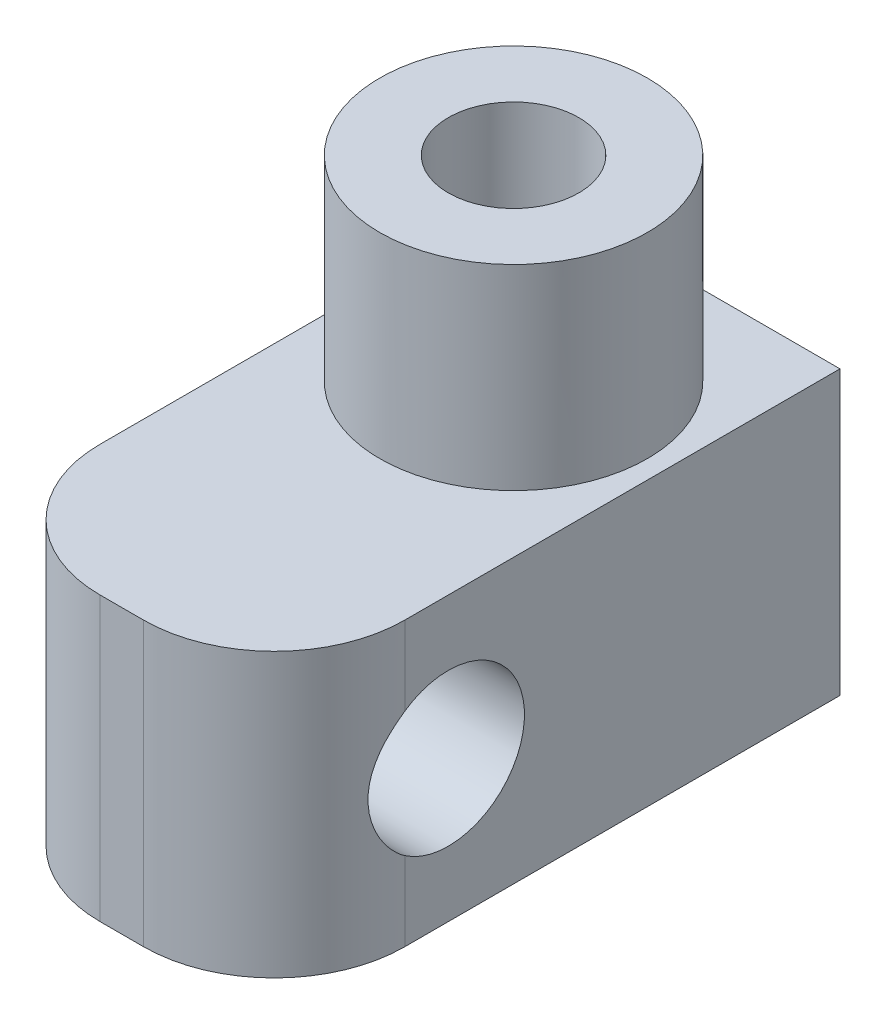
from build123d import *

# Parameters (mm, degrees)
SKETCH1_R           = 3.075
BOSS_EXTRUDE1_DEPTH = 11
BOSS_EXTRUDE2_DEPTH = 6.5
SKETCH3_R           = 1.5
CUT_EXTRUDE1_DEPTH  = 15.637281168
SKETCH4_R           = 3
CUT_EXTRUDE2_DEPTH  = 2
SKETCH5_R           = 1.75
CUT_EXTRUDE3_DEPTH  = 16.842979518


with BuildPart() as part:
    # Sketch1 → Boss-Extrude1 (new body)
    with BuildSketch(Plane(origin=(0, 0, 0), x_dir=(1, 0, 0), z_dir=(0, 1, 0))):
        with Locations(Location((0, 0, 0), (0, 0, 270))):
            Circle(SKETCH1_R)
    extrude(amount=BOSS_EXTRUDE1_DEPTH)

    # Sketch2 → Boss-Extrude2 (add)
    with BuildSketch(Plane.XZ):
        with BuildLine():
            Line((3.5, -4), (3.5, 6))
            ThreePointArc((3.5, 6), (2.621320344, 8.121320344), (0.5, 9))
            Line((0.5, 9), (0, 9))
            Line((0, 9), (-0.5, 9))
            ThreePointArc((-0.5, 9), (-2.621320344, 8.121320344), (-3.5, 6))
            Line((-3.5, 6), (-3.5, -4))
            Line((-3.5, -4), (3.5, -4))
        make_face()
    extrude(amount=-BOSS_EXTRUDE2_DEPTH)

    # Sketch3 → Cut-Extrude1 (cut, through all)
    with BuildSketch(Plane(origin=(0, 11, 0), x_dir=(1, 0, 0), z_dir=(0, 1, 0))):
        with Locations(Location((0, 0, 0), (0, 0, 270))):
            Circle(SKETCH3_R)
    extrude(amount=-CUT_EXTRUDE1_DEPTH, mode=Mode.SUBTRACT)

    # Sketch4 → Cut-Extrude2 (cut)
    with BuildSketch(Plane.XZ):
        with Locations(Location((0, 0, 0), (0, 0, 270))):
            Circle(SKETCH4_R)
    extrude(amount=-CUT_EXTRUDE2_DEPTH, mode=Mode.SUBTRACT)

    # Sketch5 → Cut-Extrude3 (cut, through all)
    with BuildSketch(Plane.ZY.offset(3.5)):
        with Locations(Location((5, 3.25, 0), (0, 0, 55.150095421))):
            Circle(SKETCH5_R)
    extrude(amount=-CUT_EXTRUDE3_DEPTH, mode=Mode.SUBTRACT)


solid = part.part
